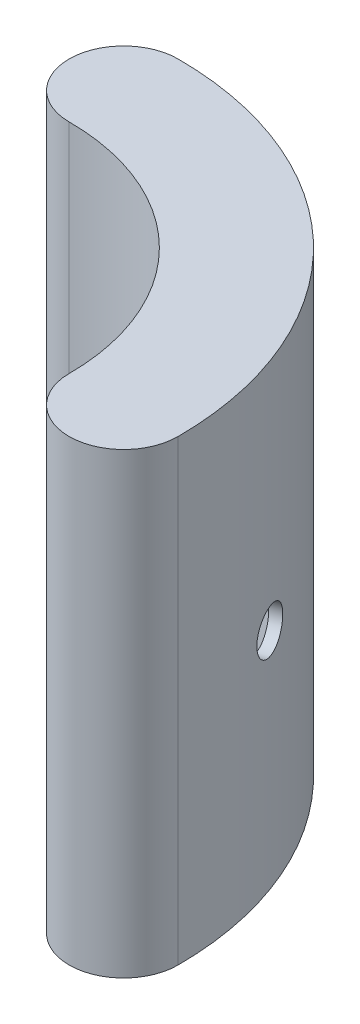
ISO-10303-21;
HEADER;
FILE_DESCRIPTION(('STEP AP214'),'2;1');
FILE_NAME('part.step','',(''),(''),'','','');
FILE_SCHEMA(('AUTOMOTIVE_DESIGN { 1 0 10303 214 1 1 1 1 }'));
ENDSEC;
DATA;
#1=APPLICATION_CONTEXT('core data for automotive mechanical design processes');
#2=APPLICATION_PROTOCOL_DEFINITION('international standard','automotive_design',2000,#1);
#3=PRODUCT_CONTEXT('',#1,'mechanical');
#4=PRODUCT('Part','Part','',(#3));
#5=PRODUCT_RELATED_PRODUCT_CATEGORY('part','',(#4));
#6=PRODUCT_DEFINITION_FORMATION('','',#4);
#7=PRODUCT_DEFINITION_CONTEXT('part definition',#1,'design');
#8=PRODUCT_DEFINITION('design','',#6,#7);
#9=PRODUCT_DEFINITION_SHAPE('','',#8);
#10=(LENGTH_UNIT() NAMED_UNIT(*) SI_UNIT(.MILLI.,.METRE.));
#11=(NAMED_UNIT(*) PLANE_ANGLE_UNIT() SI_UNIT($,.RADIAN.));
#12=(NAMED_UNIT(*) SI_UNIT($,.STERADIAN.) SOLID_ANGLE_UNIT());
#13=UNCERTAINTY_MEASURE_WITH_UNIT(LENGTH_MEASURE(1.E-05),#10,'distance_accuracy_value','');
#14=(GEOMETRIC_REPRESENTATION_CONTEXT(3) GLOBAL_UNCERTAINTY_ASSIGNED_CONTEXT((#13)) GLOBAL_UNIT_ASSIGNED_CONTEXT((#10,
#11,#12)) REPRESENTATION_CONTEXT('',''));
#15=CARTESIAN_POINT('',(0.,0.,0.));
#16=DIRECTION('',(0.,0.,1.));
#17=DIRECTION('',(1.,0.,0.));
#18=AXIS2_PLACEMENT_3D('',#15,#16,#17);
#19=CARTESIAN_POINT('',(0.,101.6,-63.5));
#20=DIRECTION('',(0.,-1.,0.));
#21=DIRECTION('',(0.,0.,-1.));
#22=AXIS2_PLACEMENT_3D('',#19,#20,#21);
#23=CYLINDRICAL_SURFACE('',#22,12.7);
#24=DIRECTION('',(0.,-1.,0.));
#25=VECTOR('',#24,1.);
#26=CARTESIAN_POINT('',(0.,101.6,-76.2));
#27=LINE('',#26,#25);
#28=CARTESIAN_POINT('',(0.,104.14,-76.2));
#29=VERTEX_POINT('',#28);
#30=CARTESIAN_POINT('',(0.,-2.54,-76.2));
#31=VERTEX_POINT('',#30);
#32=EDGE_CURVE('E109',#29,#31,#27,.T.);
#33=ORIENTED_EDGE('',*,*,#32,.T.);
#34=CARTESIAN_POINT('',(0.,-2.54,-63.5));
#35=DIRECTION('',(0.,-1.,0.));
#36=DIRECTION('',(0.,0.,-1.));
#37=AXIS2_PLACEMENT_3D('',#34,#35,#36);
#38=CIRCLE('',#37,12.7);
#39=CARTESIAN_POINT('',(0.,-2.54,-50.8));
#40=VERTEX_POINT('',#39);
#41=EDGE_CURVE('E187',#40,#31,#38,.T.);
#42=ORIENTED_EDGE('',*,*,#41,.F.);
#43=DIRECTION('',(0.,-1.,0.));
#44=VECTOR('',#43,1.);
#45=CARTESIAN_POINT('',(0.,101.6,-50.8));
#46=LINE('',#45,#44);
#47=CARTESIAN_POINT('',(0.,104.14,-50.8));
#48=VERTEX_POINT('',#47);
#49=EDGE_CURVE('E11',#48,#40,#46,.T.);
#50=ORIENTED_EDGE('',*,*,#49,.F.);
#51=CARTESIAN_POINT('',(0.,104.14,-63.5));
#52=DIRECTION('',(0.,1.,0.));
#53=DIRECTION('',(0.,0.,1.));
#54=AXIS2_PLACEMENT_3D('',#51,#52,#53);
#55=CIRCLE('',#54,12.7);
#56=EDGE_CURVE('E201',#29,#48,#55,.T.);
#57=ORIENTED_EDGE('',*,*,#56,.F.);
#58=EDGE_LOOP('',(#33,#42,#50,#57));
#59=FACE_BOUND('',#58,.T.);
#60=ADVANCED_FACE('F35',(#59),#23,.T.);
#61=CARTESIAN_POINT('',(0.,101.6,0.));
#62=DIRECTION('',(0.,-1.,0.));
#63=DIRECTION('',(0.,0.,-1.));
#64=AXIS2_PLACEMENT_3D('',#61,#62,#63);
#65=CYLINDRICAL_SURFACE('',#64,50.8);
#66=ORIENTED_EDGE('',*,*,#49,.T.);
#67=CARTESIAN_POINT('',(0.,-2.54,0.));
#68=DIRECTION('',(0.,1.,0.));
#69=DIRECTION('',(0.,0.,-1.));
#70=AXIS2_PLACEMENT_3D('',#67,#68,#69);
#71=CIRCLE('',#70,50.8);
#72=CARTESIAN_POINT('',(50.8,-2.54,0.));
#73=VERTEX_POINT('',#72);
#74=EDGE_CURVE('E175',#73,#40,#71,.T.);
#75=ORIENTED_EDGE('',*,*,#74,.F.);
#76=DIRECTION('',(0.,-1.,0.));
#77=VECTOR('',#76,1.);
#78=CARTESIAN_POINT('',(50.8,101.6,0.));
#79=LINE('',#78,#77);
#80=CARTESIAN_POINT('',(50.8,104.14,0.));
#81=VERTEX_POINT('',#80);
#82=EDGE_CURVE('E48',#81,#73,#79,.T.);
#83=ORIENTED_EDGE('',*,*,#82,.F.);
#84=CARTESIAN_POINT('',(0.,104.14,0.));
#85=DIRECTION('',(0.,-1.,0.));
#86=DIRECTION('',(0.,0.,1.));
#87=AXIS2_PLACEMENT_3D('',#84,#85,#86);
#88=CIRCLE('',#87,50.8);
#89=EDGE_CURVE('E98',#48,#81,#88,.T.);
#90=ORIENTED_EDGE('',*,*,#89,.F.);
#91=EDGE_LOOP('',(#66,#75,#83,#90));
#92=FACE_BOUND('',#91,.T.);
#93=ADVANCED_FACE('F160',(#92),#65,.F.);
#94=CARTESIAN_POINT('',(63.5,101.6,0.));
#95=DIRECTION('',(0.,-1.,0.));
#96=DIRECTION('',(0.,0.,-1.));
#97=AXIS2_PLACEMENT_3D('',#94,#95,#96);
#98=CYLINDRICAL_SURFACE('',#97,12.7);
#99=ORIENTED_EDGE('',*,*,#82,.T.);
#100=CARTESIAN_POINT('',(63.5,-2.54,0.));
#101=DIRECTION('',(0.,-1.,0.));
#102=DIRECTION('',(0.,0.,-1.));
#103=AXIS2_PLACEMENT_3D('',#100,#101,#102);
#104=CIRCLE('',#103,12.7);
#105=CARTESIAN_POINT('',(76.2,-2.54,0.));
#106=VERTEX_POINT('',#105);
#107=EDGE_CURVE('E144',#106,#73,#104,.T.);
#108=ORIENTED_EDGE('',*,*,#107,.F.);
#109=DIRECTION('',(0.,-1.,0.));
#110=VECTOR('',#109,1.);
#111=CARTESIAN_POINT('',(76.2,101.6,0.));
#112=LINE('',#111,#110);
#113=CARTESIAN_POINT('',(76.2,104.14,0.));
#114=VERTEX_POINT('',#113);
#115=EDGE_CURVE('E112',#114,#106,#112,.T.);
#116=ORIENTED_EDGE('',*,*,#115,.F.);
#117=CARTESIAN_POINT('',(63.5,104.14,0.));
#118=DIRECTION('',(0.,1.,0.));
#119=DIRECTION('',(0.,0.,1.));
#120=AXIS2_PLACEMENT_3D('',#117,#118,#119);
#121=CIRCLE('',#120,12.7);
#122=EDGE_CURVE('E193',#81,#114,#121,.T.);
#123=ORIENTED_EDGE('',*,*,#122,.F.);
#124=EDGE_LOOP('',(#99,#108,#116,#123));
#125=FACE_BOUND('',#124,.T.);
#126=ADVANCED_FACE('F154',(#125),#98,.T.);
#127=CARTESIAN_POINT('',(0.,101.6,0.));
#128=DIRECTION('',(0.,-1.,0.));
#129=DIRECTION('',(0.,0.,-1.));
#130=AXIS2_PLACEMENT_3D('',#127,#128,#129);
#131=CYLINDRICAL_SURFACE('',#130,76.2);
#132=CARTESIAN_POINT('',(22.4061096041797,49.53,-72.8313548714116));
#133=CARTESIAN_POINT('',(22.406117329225,49.3517419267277,-72.8313530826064));
#134=CARTESIAN_POINT('',(22.4205204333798,49.17335656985,-72.8269263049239));
#135=CARTESIAN_POINT('',(22.4777569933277,48.8215043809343,-72.809280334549));
#136=CARTESIAN_POINT('',(22.5206241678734,48.6480436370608,-72.7960507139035));
#137=CARTESIAN_POINT('',(22.6335097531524,48.3111886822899,-72.7610315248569));
#138=CARTESIAN_POINT('',(22.7035145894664,48.1477894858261,-72.7392462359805));
#139=CARTESIAN_POINT('',(22.8685889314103,47.8356534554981,-72.6875167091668));
#140=CARTESIAN_POINT('',(22.9636524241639,47.6869131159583,-72.6575744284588));
#141=CARTESIAN_POINT('',(23.176127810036,47.4081609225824,-72.5900784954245));
#142=CARTESIAN_POINT('',(23.2935541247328,47.2781612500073,-72.5525199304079));
#143=CARTESIAN_POINT('',(23.547287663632,47.0406840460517,-72.4705663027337));
#144=CARTESIAN_POINT('',(23.6835956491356,46.9332074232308,-72.4261709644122));
#145=CARTESIAN_POINT('',(23.9711766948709,46.7437979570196,-72.3314978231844));
#146=CARTESIAN_POINT('',(24.122454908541,46.6618739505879,-72.2812179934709));
#147=CARTESIAN_POINT('',(24.4355584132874,46.5259521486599,-72.1759706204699));
#148=CARTESIAN_POINT('',(24.5973836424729,46.4719541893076,-72.1210031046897));
#149=CARTESIAN_POINT('',(24.9268261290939,46.3934476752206,-72.0078026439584));
#150=CARTESIAN_POINT('',(25.094439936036,46.3689218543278,-71.9495716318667));
#151=CARTESIAN_POINT('',(25.4307570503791,46.3500025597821,-71.8313884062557));
#152=CARTESIAN_POINT('',(25.5994603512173,46.3556089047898,-71.7714362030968));
#153=CARTESIAN_POINT('',(25.9330641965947,46.3967803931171,-71.6515707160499));
#154=CARTESIAN_POINT('',(26.0979670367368,46.4323269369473,-71.5916574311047));
#155=CARTESIAN_POINT('',(26.4194422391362,46.5323409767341,-71.4736483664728));
#156=CARTESIAN_POINT('',(26.5760145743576,46.596808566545,-71.4155525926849));
#157=CARTESIAN_POINT('',(26.8765115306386,46.7528559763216,-71.3030077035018));
#158=CARTESIAN_POINT('',(27.0204321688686,46.8444442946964,-71.2485597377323));
#159=CARTESIAN_POINT('',(27.2915908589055,47.0521270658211,-71.1451344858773));
#160=CARTESIAN_POINT('',(27.4188288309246,47.1682216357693,-71.0961572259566));
#161=CARTESIAN_POINT('',(27.6532161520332,47.4217266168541,-71.0053201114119));
#162=CARTESIAN_POINT('',(27.7603501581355,47.5591531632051,-70.9634656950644));
#163=CARTESIAN_POINT('',(27.9514757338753,47.8513642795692,-70.8884023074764));
#164=CARTESIAN_POINT('',(28.0354672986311,48.0061488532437,-70.8551933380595));
#165=CARTESIAN_POINT('',(28.1780148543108,48.3286917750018,-70.7986256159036));
#166=CARTESIAN_POINT('',(28.2365703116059,48.4964503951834,-70.7752670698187));
#167=CARTESIAN_POINT('',(28.3266435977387,48.8401750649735,-70.739265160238));
#168=CARTESIAN_POINT('',(28.3581615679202,49.0161410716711,-70.7266217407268));
#169=CARTESIAN_POINT('',(28.3932861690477,49.3711437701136,-70.712528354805));
#170=CARTESIAN_POINT('',(28.3969137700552,49.5501780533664,-70.7110699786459));
#171=CARTESIAN_POINT('',(28.3762139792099,49.9063597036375,-70.7193792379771));
#172=CARTESIAN_POINT('',(28.3518866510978,50.0835070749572,-70.7291468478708));
#173=CARTESIAN_POINT('',(28.2759541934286,50.4308231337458,-70.7595369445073));
#174=CARTESIAN_POINT('',(28.2243586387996,50.6009942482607,-70.7801556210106));
#175=CARTESIAN_POINT('',(28.0953014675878,50.9296019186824,-70.831481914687));
#176=CARTESIAN_POINT('',(28.0178397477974,51.0880384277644,-70.8621895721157));
#177=CARTESIAN_POINT('',(27.8391077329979,51.388783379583,-70.9325967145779));
#178=CARTESIAN_POINT('',(27.7378232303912,51.5310821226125,-70.9723015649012));
#179=CARTESIAN_POINT('',(27.514238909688,51.7954147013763,-71.0592781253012));
#180=CARTESIAN_POINT('',(27.3919389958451,51.9174484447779,-71.1065498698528));
#181=CARTESIAN_POINT('',(27.1295992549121,52.1378625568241,-71.2070540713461));
#182=CARTESIAN_POINT('',(26.9895485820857,52.2362283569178,-71.2602901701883));
#183=CARTESIAN_POINT('',(26.695639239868,52.406414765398,-71.3709147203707));
#184=CARTESIAN_POINT('',(26.5417806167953,52.4782354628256,-71.4283031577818));
#185=CARTESIAN_POINT('',(26.2245960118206,52.5932674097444,-71.5453639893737));
#186=CARTESIAN_POINT('',(26.0612731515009,52.6364880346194,-71.6050356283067));
#187=CARTESIAN_POINT('',(25.7297045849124,52.6931236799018,-71.7248448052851));
#188=CARTESIAN_POINT('',(25.5614588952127,52.7065388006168,-71.7849823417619));
#189=CARTESIAN_POINT('',(25.2249413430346,52.7031815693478,-71.9039231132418));
#190=CARTESIAN_POINT('',(25.0566695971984,52.686432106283,-71.9627273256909));
#191=CARTESIAN_POINT('',(24.7247690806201,52.6232683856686,-72.0774350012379));
#192=CARTESIAN_POINT('',(24.5611403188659,52.5768540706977,-72.1333384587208));
#193=CARTESIAN_POINT('',(24.2432179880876,52.4556824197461,-72.2408095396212));
#194=CARTESIAN_POINT('',(24.0889245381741,52.3809247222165,-72.2923771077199));
#195=CARTESIAN_POINT('',(23.7941293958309,52.2051933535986,-72.3899409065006));
#196=CARTESIAN_POINT('',(23.6536272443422,52.1042205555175,-72.4359373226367));
#197=CARTESIAN_POINT('',(23.3903950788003,51.8788468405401,-72.5213666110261));
#198=CARTESIAN_POINT('',(23.2676766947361,51.7544307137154,-72.5607951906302));
#199=CARTESIAN_POINT('',(23.0436743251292,51.4856980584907,-72.6322444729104));
#200=CARTESIAN_POINT('',(22.9423956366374,51.34137662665,-72.6642633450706));
#201=CARTESIAN_POINT('',(22.7642158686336,51.0368439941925,-72.720280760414));
#202=CARTESIAN_POINT('',(22.6873346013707,50.8766200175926,-72.7442727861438));
#203=CARTESIAN_POINT('',(22.5604053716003,50.5450431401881,-72.7837383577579));
#204=CARTESIAN_POINT('',(22.5103255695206,50.3737037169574,-72.7992220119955));
#205=CARTESIAN_POINT('',(22.4516828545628,50.0894093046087,-72.8173225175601));
#206=CARTESIAN_POINT('',(22.4346153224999,49.9782976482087,-72.8225801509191));
#207=CARTESIAN_POINT('',(22.4118262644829,49.7548075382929,-72.8295968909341));
#208=CARTESIAN_POINT('',(22.4061047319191,49.6424290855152,-72.8313559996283));
#209=CARTESIAN_POINT('',(22.4061096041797,49.53,-72.8313548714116));
#210=B_SPLINE_CURVE_WITH_KNOTS('',3,(#132,#133,#134,#135,#136,#137,#138,#139,#140,#141,#142,
#143,#144,#145,#146,#147,#148,#149,#150,#151,#152,#153,#154,#155,#156,#157,#158,#159,#160,#161,
#162,#163,#164,#165,#166,#167,#168,#169,#170,#171,#172,#173,#174,#175,#176,#177,#178,#179,#180,
#181,#182,#183,#184,#185,#186,#187,#188,#189,#190,#191,#192,#193,#194,#195,#196,#197,#198,#199,
#200,#201,#202,#203,#204,#205,#206,#207,#208,#209),.UNSPECIFIED.,.T.,.F.,(4,2,2,2,2,2,2,2,2,2,2,
2,2,2,2,2,2,2,2,2,2,2,2,2,2,2,2,2,2,2,2,2,2,2,2,2,2,2,4),(0.,0.534363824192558,1.06936179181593,
1.60409249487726,2.13869500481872,2.67364344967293,3.20861346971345,3.74376829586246,
4.27891998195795,4.81375799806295,5.34859279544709,5.8830955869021,6.41760011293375,
6.95227230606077,7.48694705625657,8.02202821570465,8.55710948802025,9.09220198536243,
9.62729168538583,10.1619790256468,10.6966651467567,11.2311636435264,11.7656642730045,
12.3004844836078,12.8353071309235,13.3704581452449,13.905607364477,14.4405810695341,
14.9755529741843,15.5101191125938,16.0446862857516,16.5792602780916,17.1138164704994,
17.6487206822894,18.1837568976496,18.7192264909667,19.2540585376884,19.5910871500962,
19.9281155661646),.UNSPECIFIED.);
#211=CARTESIAN_POINT('',(22.4061096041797,49.53,-72.8313548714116));
#212=VERTEX_POINT('',#211);
#213=EDGE_CURVE('E122',#212,#212,#210,.T.);
#214=ORIENTED_EDGE('',*,*,#213,.T.);
#215=EDGE_LOOP('',(#214));
#216=FACE_BOUND('',#215,.T.);
#217=CARTESIAN_POINT('',(69.6256740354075,49.53,-30.9629700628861));
#218=CARTESIAN_POINT('',(69.6256734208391,49.3874463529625,-30.9629711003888));
#219=CARTESIAN_POINT('',(69.6281192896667,49.2449115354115,-30.957473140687));
#220=CARTESIAN_POINT('',(69.6378768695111,48.9608098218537,-30.9355176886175));
#221=CARTESIAN_POINT('',(69.645189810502,48.8192431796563,-30.919057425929));
#222=CARTESIAN_POINT('',(69.6646151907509,48.5380141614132,-30.8752645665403));
#223=CARTESIAN_POINT('',(69.6767317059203,48.3983535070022,-30.8479227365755));
#224=CARTESIAN_POINT('',(69.7056428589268,48.1219989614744,-30.7825377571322));
#225=CARTESIAN_POINT('',(69.7224392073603,47.9853061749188,-30.7444906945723));
#226=CARTESIAN_POINT('',(69.7605170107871,47.7160343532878,-30.6579923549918));
#227=CARTESIAN_POINT('',(69.7817943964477,47.5834517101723,-30.6095505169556));
#228=CARTESIAN_POINT('',(69.8286343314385,47.323161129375,-30.5025447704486));
#229=CARTESIAN_POINT('',(69.8541984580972,47.1954550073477,-30.4439771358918));
#230=CARTESIAN_POINT('',(69.909331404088,46.9459467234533,-30.3171594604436));
#231=CARTESIAN_POINT('',(69.9388978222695,46.8241410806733,-30.2489152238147));
#232=CARTESIAN_POINT('',(70.0017643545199,46.5871670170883,-30.1031441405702));
#233=CARTESIAN_POINT('',(70.0350658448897,46.4720010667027,-30.0256138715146));
#234=CARTESIAN_POINT('',(70.10510671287,46.2490414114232,-29.8617139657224));
#235=CARTESIAN_POINT('',(70.1418499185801,46.1412561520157,-29.7753344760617));
#236=CARTESIAN_POINT('',(70.2184020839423,45.9339233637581,-29.5943518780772));
#237=CARTESIAN_POINT('',(70.2582121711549,45.8343788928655,-29.4997457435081));
#238=CARTESIAN_POINT('',(70.3404958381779,45.6443074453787,-29.3030033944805));
#239=CARTESIAN_POINT('',(70.3829685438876,45.55377753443,-29.2008696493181));
#240=CARTESIAN_POINT('',(70.47021171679,45.382307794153,-28.9896932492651));
#241=CARTESIAN_POINT('',(70.5149830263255,45.3013715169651,-28.8806480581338));
#242=CARTESIAN_POINT('',(70.6064287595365,45.1496612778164,-28.6563586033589));
#243=CARTESIAN_POINT('',(70.6531042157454,45.0788929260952,-28.5411109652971));
#244=CARTESIAN_POINT('',(70.7479384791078,44.9480524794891,-28.305218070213));
#245=CARTESIAN_POINT('',(70.7960978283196,44.8879843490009,-28.1845708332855));
#246=CARTESIAN_POINT('',(70.8934542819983,44.7790273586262,-27.938782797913));
#247=CARTESIAN_POINT('',(70.9426509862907,44.730134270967,-27.8136437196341));
#248=CARTESIAN_POINT('',(71.0416899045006,44.6438352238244,-27.5596977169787));
#249=CARTESIAN_POINT('',(71.0915323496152,44.6064335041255,-27.4308894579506));
#250=CARTESIAN_POINT('',(71.241231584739,44.5120548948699,-27.0407836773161));
#251=CARTESIAN_POINT('',(71.341514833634,44.4726210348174,-26.7751639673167));
#252=CARTESIAN_POINT('',(71.5398962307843,44.441985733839,-26.2405164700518));
#253=CARTESIAN_POINT('',(71.6379944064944,44.4507836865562,-25.9714887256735));
#254=CARTESIAN_POINT('',(71.82917627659,44.5162414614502,-25.437955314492));
#255=CARTESIAN_POINT('',(71.9222676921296,44.5728252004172,-25.1734431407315));
#256=CARTESIAN_POINT('',(72.1012425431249,44.7321469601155,-24.6561514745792));
#257=CARTESIAN_POINT('',(72.1871259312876,44.8348852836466,-24.4033720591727));
#258=CARTESIAN_POINT('',(72.3498384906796,45.0836813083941,-23.9166643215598));
#259=CARTESIAN_POINT('',(72.4266604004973,45.2297734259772,-23.6827511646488));
#260=CARTESIAN_POINT('',(72.5696738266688,45.5611061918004,-23.2408363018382));
#261=CARTESIAN_POINT('',(72.6358652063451,45.7463473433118,-23.032834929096));
#262=CARTESIAN_POINT('',(72.7566235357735,46.1511492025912,-22.6484984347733));
#263=CARTESIAN_POINT('',(72.8111676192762,46.3707759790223,-22.4722257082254));
#264=CARTESIAN_POINT('',(72.907677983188,46.837883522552,-22.1571148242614));
#265=CARTESIAN_POINT('',(72.9496442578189,47.0853643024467,-22.0182766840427));
#266=CARTESIAN_POINT('',(73.0204759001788,47.6011977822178,-21.782225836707));
#267=CARTESIAN_POINT('',(73.0493403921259,47.8695518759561,-21.685015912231));
#268=CARTESIAN_POINT('',(73.0936440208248,48.4194945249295,-21.5352120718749));
#269=CARTESIAN_POINT('',(73.1090833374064,48.7010829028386,-21.4826175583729));
#270=CARTESIAN_POINT('',(73.1263635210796,49.2689208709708,-21.4237232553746));
#271=CARTESIAN_POINT('',(73.1282304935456,49.5551604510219,-21.417334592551));
#272=CARTESIAN_POINT('',(73.1184167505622,50.1246853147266,-21.4508140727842));
#273=CARTESIAN_POINT('',(73.1067361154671,50.4079706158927,-21.4906819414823));
#274=CARTESIAN_POINT('',(73.0699607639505,50.9632834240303,-21.6153882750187));
#275=CARTESIAN_POINT('',(73.0448782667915,51.235320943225,-21.7001857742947));
#276=CARTESIAN_POINT('',(72.9815754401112,51.7607252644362,-21.9121383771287));
#277=CARTESIAN_POINT('',(72.9433549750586,52.0140918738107,-22.0392939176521));
#278=CARTESIAN_POINT('',(72.854166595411,52.4953865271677,-22.3323490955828));
#279=CARTESIAN_POINT('',(72.8031793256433,52.7232751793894,-22.4983075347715));
#280=CARTESIAN_POINT('',(72.6891916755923,53.146747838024,-22.8639011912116));
#281=CARTESIAN_POINT('',(72.6261911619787,53.3423314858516,-23.0635367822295));
#282=CARTESIAN_POINT('',(72.4890839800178,53.6959554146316,-23.4909143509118));
#283=CARTESIAN_POINT('',(72.4149599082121,53.8539358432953,-23.7187002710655));
#284=CARTESIAN_POINT('',(72.2570666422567,54.1274575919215,-24.1954389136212));
#285=CARTESIAN_POINT('',(72.1732975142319,54.2429992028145,-24.444391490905));
#286=CARTESIAN_POINT('',(71.9980171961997,54.4282652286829,-24.9559325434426));
#287=CARTESIAN_POINT('',(71.9065124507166,54.4980273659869,-25.2185095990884));
#288=CARTESIAN_POINT('',(71.7178723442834,54.5898567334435,-25.750069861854));
#289=CARTESIAN_POINT('',(71.6207370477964,54.611924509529,-26.0190529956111));
#290=CARTESIAN_POINT('',(71.4730426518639,54.6088373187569,-26.4209146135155));
#291=CARTESIAN_POINT('',(71.4235011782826,54.6017876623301,-26.5545420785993));
#292=CARTESIAN_POINT('',(71.3240633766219,54.5757369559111,-26.8204784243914));
#293=CARTESIAN_POINT('',(71.2741671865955,54.5567403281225,-26.952787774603));
#294=CARTESIAN_POINT('',(71.174378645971,54.5069177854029,-27.2152082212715));
#295=CARTESIAN_POINT('',(71.1244863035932,54.476087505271,-27.3453184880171));
#296=CARTESIAN_POINT('',(71.0251324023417,54.4028357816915,-27.602346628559));
#297=CARTESIAN_POINT('',(70.9756706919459,54.3604186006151,-27.7292656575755));
#298=CARTESIAN_POINT('',(70.8775475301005,54.2642743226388,-27.979122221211));
#299=CARTESIAN_POINT('',(70.8288863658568,54.210543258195,-28.1020583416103));
#300=CARTESIAN_POINT('',(70.7328099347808,54.092185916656,-28.3430135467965));
#301=CARTESIAN_POINT('',(70.6853942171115,54.0275636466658,-28.4610344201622));
#302=CARTESIAN_POINT('',(70.5921853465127,53.8878457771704,-28.6914415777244));
#303=CARTESIAN_POINT('',(70.5463927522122,53.8127466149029,-28.803825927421));
#304=CARTESIAN_POINT('',(70.4568712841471,53.6526537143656,-29.0221157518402));
#305=CARTESIAN_POINT('',(70.4131416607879,53.5676636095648,-29.1280235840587));
#306=CARTESIAN_POINT('',(70.3280333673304,53.3881703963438,-29.3329176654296));
#307=CARTESIAN_POINT('',(70.2866600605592,53.2936468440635,-29.431888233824));
#308=CARTESIAN_POINT('',(70.2067702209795,53.0959482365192,-29.6219520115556));
#309=CARTESIAN_POINT('',(70.1682526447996,52.992776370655,-29.7130480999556));
#310=CARTESIAN_POINT('',(70.0944023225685,52.77841417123,-29.8868480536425));
#311=CARTESIAN_POINT('',(70.0590715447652,52.6672189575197,-29.9695467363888));
#312=CARTESIAN_POINT('',(69.9919778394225,52.4376949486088,-30.1259070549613));
#313=CARTESIAN_POINT('',(69.9602136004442,52.3193688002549,-30.1995720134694));
#314=CARTESIAN_POINT('',(69.9005008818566,52.0761723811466,-30.3375285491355));
#315=CARTESIAN_POINT('',(69.8725590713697,51.9512911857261,-30.4018037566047));
#316=CARTESIAN_POINT('',(69.8208474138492,51.6961070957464,-30.5203776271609));
#317=CARTESIAN_POINT('',(69.7970760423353,51.5658062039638,-30.5746799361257));
#318=CARTESIAN_POINT('',(69.7539540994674,51.3007771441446,-30.6729321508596));
#319=CARTESIAN_POINT('',(69.7345997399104,51.166052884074,-30.7168909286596));
#320=CARTESIAN_POINT('',(69.7004901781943,50.8930765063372,-30.7942113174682));
#321=CARTESIAN_POINT('',(69.6857338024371,50.7548252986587,-30.8275756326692));
#322=CARTESIAN_POINT('',(69.6575510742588,50.4372193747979,-30.8912143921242));
#323=CARTESIAN_POINT('',(69.6456132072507,50.2570415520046,-30.9181005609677));
#324=CARTESIAN_POINT('',(69.6296750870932,49.8945655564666,-30.9539777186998));
#325=CARTESIAN_POINT('',(69.6256748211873,49.71226738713,-30.9629687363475));
#326=CARTESIAN_POINT('',(69.6256740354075,49.53,-30.9629700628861));
#327=B_SPLINE_CURVE_WITH_KNOTS('',3,(#217,#218,#219,#220,#221,#222,#223,#224,#225,#226,#227,
#228,#229,#230,#231,#232,#233,#234,#235,#236,#237,#238,#239,#240,#241,#242,#243,#244,#245,#246,
#247,#248,#249,#250,#251,#252,#253,#254,#255,#256,#257,#258,#259,#260,#261,#262,#263,#264,#265,
#266,#267,#268,#269,#270,#271,#272,#273,#274,#275,#276,#277,#278,#279,#280,#281,#282,#283,#284,
#285,#286,#287,#288,#289,#290,#291,#292,#293,#294,#295,#296,#297,#298,#299,#300,#301,#302,#303,
#304,#305,#306,#307,#308,#309,#310,#311,#312,#313,#314,#315,#316,#317,#318,#319,#320,#321,#322,
#323,#324,#325,#326),.UNSPECIFIED.,.T.,.F.,(4,2,2,2,2,2,2,2,2,2,2,2,2,2,2,2,2,2,2,2,2,2,2,2,2,2,
2,2,2,2,2,2,2,2,2,2,2,2,2,2,2,2,2,2,2,2,2,2,2,2,2,2,2,2,4),(0.,0.427501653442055,
0.855111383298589,1.28308472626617,1.71121470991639,2.13895756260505,2.56685815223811,
2.99450315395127,3.42230625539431,3.85059096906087,4.27903390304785,4.70733691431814,
5.13579801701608,5.56449462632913,5.99334973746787,6.42204233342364,6.85089290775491,
7.70638479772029,8.56186593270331,9.41598755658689,10.2701147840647,11.1249218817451,
11.9797399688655,12.8362211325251,13.6927026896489,14.5492414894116,15.4057688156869,
16.2606482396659,17.1155225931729,17.969618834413,18.8237238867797,19.6791317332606,
20.5345490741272,21.3913189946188,22.2480830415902,23.1041402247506,23.9601876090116,
24.3878408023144,24.8153357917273,25.2429886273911,25.6704843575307,26.098130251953,
26.5256191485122,26.9532537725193,27.3807317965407,27.8091468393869,28.2374045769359,
28.6659250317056,29.0942873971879,29.523387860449,29.9523311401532,30.3809051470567,
30.8093696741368,31.3559690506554,31.9025675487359),.UNSPECIFIED.);
#328=CARTESIAN_POINT('',(69.6256740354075,49.53,-30.9629700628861));
#329=VERTEX_POINT('',#328);
#330=EDGE_CURVE('E121',#329,#329,#327,.T.);
#331=ORIENTED_EDGE('',*,*,#330,.T.);
#332=EDGE_LOOP('',(#331));
#333=FACE_BOUND('',#332,.T.);
#334=ORIENTED_EDGE('',*,*,#115,.T.);
#335=CARTESIAN_POINT('',(0.,-2.54,0.));
#336=DIRECTION('',(0.,-1.,0.));
#337=DIRECTION('',(0.,0.,-1.));
#338=AXIS2_PLACEMENT_3D('',#335,#336,#337);
#339=CIRCLE('',#338,76.2);
#340=EDGE_CURVE('E191',#31,#106,#339,.T.);
#341=ORIENTED_EDGE('',*,*,#340,.F.);
#342=ORIENTED_EDGE('',*,*,#32,.F.);
#343=CARTESIAN_POINT('',(0.,104.14,0.));
#344=DIRECTION('',(0.,1.,0.));
#345=DIRECTION('',(0.,0.,1.));
#346=AXIS2_PLACEMENT_3D('',#343,#344,#345);
#347=CIRCLE('',#346,76.2);
#348=EDGE_CURVE('E198',#114,#29,#347,.T.);
#349=ORIENTED_EDGE('',*,*,#348,.F.);
#350=EDGE_LOOP('',(#334,#341,#342,#349));
#351=FACE_BOUND('',#350,.T.);
#352=ADVANCED_FACE('F148',(#216,#333,#351),#131,.T.);
#353=CARTESIAN_POINT('',(31.75,104.14,0.));
#354=DIRECTION('',(0.,1.,0.));
#355=DIRECTION('',(0.,0.,1.));
#356=AXIS2_PLACEMENT_3D('',#353,#354,#355);
#357=PLANE('',#356);
#358=ORIENTED_EDGE('',*,*,#122,.T.);
#359=ORIENTED_EDGE('',*,*,#348,.T.);
#360=ORIENTED_EDGE('',*,*,#56,.T.);
#361=ORIENTED_EDGE('',*,*,#89,.T.);
#362=EDGE_LOOP('',(#358,#359,#360,#361));
#363=FACE_BOUND('',#362,.T.);
#364=ADVANCED_FACE('F153',(#363),#357,.T.);
#365=CARTESIAN_POINT('',(31.75,-2.54,0.));
#366=DIRECTION('',(0.,-1.,0.));
#367=DIRECTION('',(0.,0.,-1.));
#368=AXIS2_PLACEMENT_3D('',#365,#366,#367);
#369=PLANE('',#368);
#370=ORIENTED_EDGE('',*,*,#107,.T.);
#371=ORIENTED_EDGE('',*,*,#74,.T.);
#372=ORIENTED_EDGE('',*,*,#41,.T.);
#373=ORIENTED_EDGE('',*,*,#340,.T.);
#374=EDGE_LOOP('',(#370,#371,#372,#373));
#375=FACE_BOUND('',#374,.T.);
#376=ADVANCED_FACE('F131',(#375),#369,.T.);
#377=CARTESIAN_POINT('',(66.6119785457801,49.53,-24.4457012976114));
#378=DIRECTION('',(0.938779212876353,0.,-0.344519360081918));
#379=DIRECTION('',(-0.344519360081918,0.,-0.938779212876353));
#380=AXIS2_PLACEMENT_3D('',#377,#378,#379);
#381=CYLINDRICAL_SURFACE('',#380,5.08);
#382=CARTESIAN_POINT('',(67.2356742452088,49.53,-30.0858722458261));
#383=CARTESIAN_POINT('',(67.2356736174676,49.3874583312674,-30.0858732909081));
#384=CARTESIAN_POINT('',(67.238132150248,49.2449356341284,-30.0803810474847));
#385=CARTESIAN_POINT('',(67.2479399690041,48.960858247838,-30.058448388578));
#386=CARTESIAN_POINT('',(67.2552904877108,48.8193038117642,-30.0420052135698));
#387=CARTESIAN_POINT('',(67.2748148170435,48.5380997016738,-29.9982576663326));
#388=CARTESIAN_POINT('',(67.286992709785,48.3984517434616,-29.970944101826));
#389=CARTESIAN_POINT('',(67.3160485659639,48.1221225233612,-29.9056262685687));
#390=CARTESIAN_POINT('',(67.3329282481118,47.9854423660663,-29.8676180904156));
#391=CARTESIAN_POINT('',(67.3711919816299,47.7161960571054,-29.7812074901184));
#392=CARTESIAN_POINT('',(67.3925719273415,47.5836262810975,-29.7328145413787));
#393=CARTESIAN_POINT('',(67.4396333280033,47.323360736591,-29.6259154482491));
#394=CARTESIAN_POINT('',(67.4653163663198,47.1956667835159,-29.5674055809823));
#395=CARTESIAN_POINT('',(67.5206999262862,46.9461814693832,-29.4407108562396));
#396=CARTESIAN_POINT('',(67.5503980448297,46.8243866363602,-29.3725317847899));
#397=CARTESIAN_POINT('',(67.6135370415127,46.5874324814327,-29.2268969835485));
#398=CARTESIAN_POINT('',(67.6469792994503,46.4722756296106,-29.1494378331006));
#399=CARTESIAN_POINT('',(67.7173102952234,46.2493210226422,-28.9856763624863));
#400=CARTESIAN_POINT('',(67.7542031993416,46.1415324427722,-28.899363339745));
#401=CARTESIAN_POINT('',(67.8310562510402,45.9341919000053,-28.718514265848));
#402=CARTESIAN_POINT('',(67.8710175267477,45.8346429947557,-28.6239751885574));
#403=CARTESIAN_POINT('',(67.9536007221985,45.6445613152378,-28.4273655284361));
#404=CARTESIAN_POINT('',(67.9962217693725,45.5540256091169,-28.3252974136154));
#405=CARTESIAN_POINT('',(68.083754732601,45.3825428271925,-28.1142489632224));
#406=CARTESIAN_POINT('',(68.1286674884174,45.3015993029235,-28.0052660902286));
#407=CARTESIAN_POINT('',(68.2203883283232,45.1498681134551,-27.7810886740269));
#408=CARTESIAN_POINT('',(68.2671975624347,45.0790867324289,-27.6658903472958));
#409=CARTESIAN_POINT('',(68.3622850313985,44.9482203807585,-27.43008850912));
#410=CARTESIAN_POINT('',(68.4105638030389,44.8881393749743,-27.3094830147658));
#411=CARTESIAN_POINT('',(68.5081412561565,44.7791571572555,-27.0637696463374));
#412=CARTESIAN_POINT('',(68.5574395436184,44.7302517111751,-26.9386634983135));
#413=CARTESIAN_POINT('',(68.6566610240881,44.6439287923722,-26.6847735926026));
#414=CARTESIAN_POINT('',(68.7065844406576,44.6065155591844,-26.5559884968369));
#415=CARTESIAN_POINT('',(68.8564811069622,44.5121108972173,-26.1659638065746));
#416=CARTESIAN_POINT('',(68.9568463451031,44.4726593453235,-25.9003876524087));
#417=CARTESIAN_POINT('',(69.1552889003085,44.4419853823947,-25.3657853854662));
#418=CARTESIAN_POINT('',(69.2533662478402,44.4507623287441,-25.0967593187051));
#419=CARTESIAN_POINT('',(69.4443946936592,44.5161713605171,-24.5632196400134));
#420=CARTESIAN_POINT('',(69.5373542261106,44.5727220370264,-24.298699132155));
#421=CARTESIAN_POINT('',(69.7159794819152,44.7319635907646,-23.7813533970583));
#422=CARTESIAN_POINT('',(69.8016451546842,44.8346547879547,-23.5285282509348));
#423=CARTESIAN_POINT('',(69.9638649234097,45.0833496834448,-23.0416831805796));
#424=CARTESIAN_POINT('',(70.0404112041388,45.2293901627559,-22.8076794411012));
#425=CARTESIAN_POINT('',(70.1828422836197,45.5606125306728,-22.3655602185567));
#426=CARTESIAN_POINT('',(70.2487269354,45.7457949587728,-22.1574450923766));
#427=CARTESIAN_POINT('',(70.3688836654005,46.1505038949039,-21.7728404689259));
#428=CARTESIAN_POINT('',(70.4231312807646,46.3701011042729,-21.5964177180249));
#429=CARTESIAN_POINT('',(70.5190846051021,46.8371587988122,-21.2810143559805));
#430=CARTESIAN_POINT('',(70.5607903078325,47.0846192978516,-21.1420337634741));
#431=CARTESIAN_POINT('',(70.6311674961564,47.6004255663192,-20.9057182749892));
#432=CARTESIAN_POINT('',(70.6598380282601,47.8687728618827,-20.8083864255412));
#433=CARTESIAN_POINT('',(70.703842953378,48.4187137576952,-20.6583725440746));
#434=CARTESIAN_POINT('',(70.7191775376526,48.7003071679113,-20.6056898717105));
#435=CARTESIAN_POINT('',(70.7363493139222,49.2681262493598,-20.5466651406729));
#436=CARTESIAN_POINT('',(70.7382142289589,49.5543411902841,-20.5402279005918));
#437=CARTESIAN_POINT('',(70.7285032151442,50.1238242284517,-20.5736414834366));
#438=CARTESIAN_POINT('',(70.7169273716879,50.4070923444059,-20.6134920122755));
#439=CARTESIAN_POINT('',(70.6804594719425,50.9623599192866,-20.7381874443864));
#440=CARTESIAN_POINT('',(70.6555804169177,51.2343701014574,-20.8229884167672));
#441=CARTESIAN_POINT('',(70.592762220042,51.7597317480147,-21.0349630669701));
#442=CARTESIAN_POINT('',(70.5548229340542,52.0130830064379,-21.1621372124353));
#443=CARTESIAN_POINT('',(70.4662411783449,52.4943889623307,-21.4552521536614));
#444=CARTESIAN_POINT('',(70.4155780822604,52.7223015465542,-21.6212558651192));
#445=CARTESIAN_POINT('',(70.3022499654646,53.1458358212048,-21.986945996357));
#446=CARTESIAN_POINT('',(70.2395848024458,53.3414571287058,-22.1866328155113));
#447=CARTESIAN_POINT('',(70.103115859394,53.6951913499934,-22.6141347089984));
#448=CARTESIAN_POINT('',(70.0292933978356,53.85324018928,-22.8419968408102));
#449=CARTESIAN_POINT('',(69.8719418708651,54.1269027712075,-23.3188823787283));
#450=CARTESIAN_POINT('',(69.7884128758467,54.2425168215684,-23.5679056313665));
#451=CARTESIAN_POINT('',(69.6135293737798,54.4279224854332,-24.0795591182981));
#452=CARTESIAN_POINT('',(69.5221818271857,54.4977543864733,-24.3421771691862));
#453=CARTESIAN_POINT('',(69.3337519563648,54.5897244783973,-24.8737963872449));
#454=CARTESIAN_POINT('',(69.2366697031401,54.6118632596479,-25.1427974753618));
#455=CARTESIAN_POINT('',(69.0889799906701,54.6088814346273,-25.544647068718));
#456=CARTESIAN_POINT('',(69.0394310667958,54.6018684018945,-25.6782549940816));
#457=CARTESIAN_POINT('',(68.9399519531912,54.5758936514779,-25.9441457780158));
#458=CARTESIAN_POINT('',(68.8900219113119,54.5569363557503,-26.0764291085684));
#459=CARTESIAN_POINT('',(68.790140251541,54.5071950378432,-26.3387914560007));
#460=CARTESIAN_POINT('',(68.7401886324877,54.4764066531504,-26.4688696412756));
#461=CARTESIAN_POINT('',(68.6406924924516,54.4032411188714,-26.7258284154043));
#462=CARTESIAN_POINT('',(68.5911478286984,54.3608682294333,-26.8527101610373));
#463=CARTESIAN_POINT('',(68.4928375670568,54.2648150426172,-27.1024874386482));
#464=CARTESIAN_POINT('',(68.444072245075,54.2111308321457,-27.2253815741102));
#465=CARTESIAN_POINT('',(68.3477689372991,54.0928693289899,-27.4662501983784));
#466=CARTESIAN_POINT('',(68.3002305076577,54.0282960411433,-27.5842264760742));
#467=CARTESIAN_POINT('',(68.2067608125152,53.8886779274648,-27.8145435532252));
#468=CARTESIAN_POINT('',(68.1608301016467,53.8136295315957,-27.926882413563));
#469=CARTESIAN_POINT('',(68.071020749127,53.6536394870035,-28.1450821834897));
#470=CARTESIAN_POINT('',(68.0271413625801,53.5687014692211,-28.2509454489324));
#471=CARTESIAN_POINT('',(67.9417196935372,53.3893012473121,-28.4557668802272));
#472=CARTESIAN_POINT('',(67.9001830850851,53.2948173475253,-28.5547084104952));
#473=CARTESIAN_POINT('',(67.819963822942,53.0971957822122,-28.7447167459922));
#474=CARTESIAN_POINT('',(67.7812801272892,52.9940613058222,-28.8357864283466));
#475=CARTESIAN_POINT('',(67.7070989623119,52.7797711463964,-29.0095377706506));
#476=CARTESIAN_POINT('',(67.6716034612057,52.6686105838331,-29.0922142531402));
#477=CARTESIAN_POINT('',(67.604186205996,52.4391524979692,-29.2485359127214));
#478=CARTESIAN_POINT('',(67.5722631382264,52.3208576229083,-29.3221844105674));
#479=CARTESIAN_POINT('',(67.5122406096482,52.0777120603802,-29.460119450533));
#480=CARTESIAN_POINT('',(67.4841480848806,51.9528500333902,-29.5243890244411));
#481=CARTESIAN_POINT('',(67.4321496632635,51.6976992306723,-29.6429584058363));
#482=CARTESIAN_POINT('',(67.4082422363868,51.5674124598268,-29.6972618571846));
#483=CARTESIAN_POINT('',(67.3648664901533,51.3024061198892,-29.7955239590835));
#484=CARTESIAN_POINT('',(67.3453943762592,51.167690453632,-29.8394914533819));
#485=CARTESIAN_POINT('',(67.3110706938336,50.8947260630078,-29.9168372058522));
#486=CARTESIAN_POINT('',(67.296217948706,50.7564782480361,-29.9502181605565));
#487=CARTESIAN_POINT('',(67.2678196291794,50.4386115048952,-30.0139567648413));
#488=CARTESIAN_POINT('',(67.2557814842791,50.2581615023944,-30.0409027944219));
#489=CARTESIAN_POINT('',(67.2397092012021,49.8951306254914,-30.0768598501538));
#490=CARTESIAN_POINT('',(67.2356750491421,49.7125497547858,-30.0858709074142));
#491=CARTESIAN_POINT('',(67.2356742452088,49.53,-30.0858722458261));
#492=B_SPLINE_CURVE_WITH_KNOTS('',3,(#382,#383,#384,#385,#386,#387,#388,#389,#390,#391,#392,
#393,#394,#395,#396,#397,#398,#399,#400,#401,#402,#403,#404,#405,#406,#407,#408,#409,#410,#411,
#412,#413,#414,#415,#416,#417,#418,#419,#420,#421,#422,#423,#424,#425,#426,#427,#428,#429,#430,
#431,#432,#433,#434,#435,#436,#437,#438,#439,#440,#441,#442,#443,#444,#445,#446,#447,#448,#449,
#450,#451,#452,#453,#454,#455,#456,#457,#458,#459,#460,#461,#462,#463,#464,#465,#466,#467,#468,
#469,#470,#471,#472,#473,#474,#475,#476,#477,#478,#479,#480,#481,#482,#483,#484,#485,#486,#487,
#488,#489,#490,#491),.UNSPECIFIED.,.T.,.F.,(4,2,2,2,2,2,2,2,2,2,2,2,2,2,2,2,2,2,2,2,2,2,2,2,2,2,
2,2,2,2,2,2,2,2,2,2,2,2,2,2,2,2,2,2,2,2,2,2,2,2,2,2,2,2,4),(0.,0.427465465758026,
0.855038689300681,1.28297425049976,1.71106644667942,2.13876976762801,2.56663081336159,
2.99423690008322,3.42200109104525,3.85028859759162,4.27873433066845,4.70704023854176,
5.13550423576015,5.56423206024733,5.99311841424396,6.42184200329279,6.85072356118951,
7.7061870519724,8.5616391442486,9.41563643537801,10.2696396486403,11.1243695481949,
11.9791112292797,12.8356324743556,13.6921541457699,14.5487384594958,15.4053104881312,
16.2601190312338,17.1149221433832,17.9688913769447,18.8228700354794,19.6782421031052,
20.5336243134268,21.3904549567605,22.2472793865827,23.1033488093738,23.9594076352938,
24.3870083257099,24.8144508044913,25.2420510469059,25.6694942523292,26.0970855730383,
26.5245199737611,26.9521004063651,27.3795243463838,27.8079425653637,28.2362035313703,
28.6647270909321,29.0930925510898,29.5222236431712,29.9511975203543,30.379803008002,
30.8082992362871,31.3557451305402,31.9031900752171),.UNSPECIFIED.);
#493=CARTESIAN_POINT('',(67.2356742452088,49.53,-30.0858722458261));
#494=VERTEX_POINT('',#493);
#495=EDGE_CURVE('E116',#494,#494,#492,.T.);
#496=ORIENTED_EDGE('',*,*,#495,.T.);
#497=EDGE_LOOP('',(#496));
#498=FACE_BOUND('',#497,.T.);
#499=ORIENTED_EDGE('',*,*,#330,.F.);
#500=EDGE_LOOP('',(#499));
#501=FACE_BOUND('',#500,.T.);
#502=ADVANCED_FACE('F127',(#498,#501),#381,.F.);
#503=CARTESIAN_POINT('',(31.75,0.,0.));
#504=DIRECTION('',(0.,-1.,0.));
#505=DIRECTION('',(0.,0.,-1.));
#506=AXIS2_PLACEMENT_3D('',#503,#504,#505);
#507=PLANE('',#506);
#508=CARTESIAN_POINT('',(0.,0.,-63.5));
#509=DIRECTION('',(0.,1.,0.));
#510=DIRECTION('',(0.,0.,1.));
#511=AXIS2_PLACEMENT_3D('',#508,#509,#510);
#512=CIRCLE('',#511,10.16);
#513=CARTESIAN_POINT('',(0.,0.,-73.66));
#514=VERTEX_POINT('',#513);
#515=CARTESIAN_POINT('',(0.,0.,-53.34));
#516=VERTEX_POINT('',#515);
#517=EDGE_CURVE('E96',#514,#516,#512,.T.);
#518=ORIENTED_EDGE('',*,*,#517,.T.);
#519=CARTESIAN_POINT('',(0.,0.,0.));
#520=DIRECTION('',(0.,-1.,0.));
#521=DIRECTION('',(0.,0.,-1.));
#522=AXIS2_PLACEMENT_3D('',#519,#520,#521);
#523=CIRCLE('',#522,53.34);
#524=CARTESIAN_POINT('',(53.34,0.,0.));
#525=VERTEX_POINT('',#524);
#526=EDGE_CURVE('E75',#516,#525,#523,.T.);
#527=ORIENTED_EDGE('',*,*,#526,.T.);
#528=CARTESIAN_POINT('',(63.5,0.,0.));
#529=DIRECTION('',(0.,1.,0.));
#530=DIRECTION('',(0.,0.,1.));
#531=AXIS2_PLACEMENT_3D('',#528,#529,#530);
#532=CIRCLE('',#531,10.16);
#533=CARTESIAN_POINT('',(73.66,0.,0.));
#534=VERTEX_POINT('',#533);
#535=EDGE_CURVE('E85',#525,#534,#532,.T.);
#536=ORIENTED_EDGE('',*,*,#535,.T.);
#537=CARTESIAN_POINT('',(0.,0.,0.));
#538=DIRECTION('',(0.,1.,0.));
#539=DIRECTION('',(0.,0.,-1.));
#540=AXIS2_PLACEMENT_3D('',#537,#538,#539);
#541=CIRCLE('',#540,73.66);
#542=EDGE_CURVE('E91',#534,#514,#541,.T.);
#543=ORIENTED_EDGE('',*,*,#542,.T.);
#544=EDGE_LOOP('',(#518,#527,#536,#543));
#545=FACE_BOUND('',#544,.T.);
#546=ADVANCED_FACE('F94',(#545),#507,.F.);
#547=CARTESIAN_POINT('',(31.75,101.6,0.));
#548=DIRECTION('',(0.,1.,0.));
#549=DIRECTION('',(0.,0.,1.));
#550=AXIS2_PLACEMENT_3D('',#547,#548,#549);
#551=PLANE('',#550);
#552=CARTESIAN_POINT('',(0.,101.6,-63.5));
#553=DIRECTION('',(0.,1.,0.));
#554=DIRECTION('',(0.,0.,1.));
#555=AXIS2_PLACEMENT_3D('',#552,#553,#554);
#556=CIRCLE('',#555,10.16);
#557=CARTESIAN_POINT('',(0.,101.6,-73.66));
#558=VERTEX_POINT('',#557);
#559=CARTESIAN_POINT('',(0.,101.6,-53.34));
#560=VERTEX_POINT('',#559);
#561=EDGE_CURVE('E56',#558,#560,#556,.T.);
#562=ORIENTED_EDGE('',*,*,#561,.F.);
#563=CARTESIAN_POINT('',(0.,101.6,0.));
#564=DIRECTION('',(0.,1.,0.));
#565=DIRECTION('',(0.,0.,-1.));
#566=AXIS2_PLACEMENT_3D('',#563,#564,#565);
#567=CIRCLE('',#566,73.66);
#568=CARTESIAN_POINT('',(73.66,101.6,0.));
#569=VERTEX_POINT('',#568);
#570=EDGE_CURVE('E106',#569,#558,#567,.T.);
#571=ORIENTED_EDGE('',*,*,#570,.F.);
#572=CARTESIAN_POINT('',(63.5,101.6,0.));
#573=DIRECTION('',(0.,1.,0.));
#574=DIRECTION('',(0.,0.,1.));
#575=AXIS2_PLACEMENT_3D('',#572,#573,#574);
#576=CIRCLE('',#575,10.16);
#577=CARTESIAN_POINT('',(53.34,101.6,0.));
#578=VERTEX_POINT('',#577);
#579=EDGE_CURVE('E206',#578,#569,#576,.T.);
#580=ORIENTED_EDGE('',*,*,#579,.F.);
#581=CARTESIAN_POINT('',(0.,101.6,0.));
#582=DIRECTION('',(0.,-1.,0.));
#583=DIRECTION('',(0.,0.,-1.));
#584=AXIS2_PLACEMENT_3D('',#581,#582,#583);
#585=CIRCLE('',#584,53.34);
#586=EDGE_CURVE('E78',#560,#578,#585,.T.);
#587=ORIENTED_EDGE('',*,*,#586,.F.);
#588=EDGE_LOOP('',(#562,#571,#580,#587));
#589=FACE_BOUND('',#588,.T.);
#590=ADVANCED_FACE('F226',(#589),#551,.F.);
#591=CARTESIAN_POINT('',(0.,101.6,0.));
#592=DIRECTION('',(0.,-1.,0.));
#593=DIRECTION('',(0.,0.,-1.));
#594=AXIS2_PLACEMENT_3D('',#591,#592,#593);
#595=CYLINDRICAL_SURFACE('',#594,73.66);
#596=CARTESIAN_POINT('',(21.5579712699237,49.53,-70.4347178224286));
#597=CARTESIAN_POINT('',(21.5579790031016,49.3517477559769,-70.4347160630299));
#598=CARTESIAN_POINT('',(21.5723884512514,49.1733683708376,-70.4303101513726));
#599=CARTESIAN_POINT('',(21.6296494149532,48.8215283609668,-70.4127454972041));
#600=CARTESIAN_POINT('',(21.6725346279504,48.6480738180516,-70.3995763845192));
#601=CARTESIAN_POINT('',(21.7854652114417,48.3112312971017,-70.3647111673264));
#602=CARTESIAN_POINT('',(21.855496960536,48.14783831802,-70.3430193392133));
#603=CARTESIAN_POINT('',(22.0206303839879,47.8357134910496,-70.2914993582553));
#604=CARTESIAN_POINT('',(22.1157260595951,47.686978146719,-70.2616731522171));
#605=CARTESIAN_POINT('',(22.3282710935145,47.4082283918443,-70.194417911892));
#606=CARTESIAN_POINT('',(22.4457357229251,47.2782268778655,-70.1569836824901));
#607=CARTESIAN_POINT('',(22.6995445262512,47.0407446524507,-70.0752739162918));
#608=CARTESIAN_POINT('',(22.8358894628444,46.9332648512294,-70.0309981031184));
#609=CARTESIAN_POINT('',(23.1235428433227,46.7438451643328,-69.9365444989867));
#610=CARTESIAN_POINT('',(23.2748568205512,46.6619147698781,-69.8863645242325));
#611=CARTESIAN_POINT('',(23.5880235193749,46.5259806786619,-69.7812868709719));
#612=CARTESIAN_POINT('',(23.7498761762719,46.4719768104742,-69.7263892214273));
#613=CARTESIAN_POINT('',(24.0793552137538,46.3934612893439,-69.6132929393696));
#614=CARTESIAN_POINT('',(24.246977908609,46.3689311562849,-69.5550963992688));
#615=CARTESIAN_POINT('',(24.5832992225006,46.3500024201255,-69.4369409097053));
#616=CARTESIAN_POINT('',(24.7519978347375,46.355603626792,-69.3769819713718));
#617=CARTESIAN_POINT('',(25.0855713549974,46.3967631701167,-69.2570654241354));
#618=CARTESIAN_POINT('',(25.250448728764,46.4323016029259,-69.1971078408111));
#619=CARTESIAN_POINT('',(25.571862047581,46.5322959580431,-69.0789751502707));
#620=CARTESIAN_POINT('',(25.7283979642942,46.5967519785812,-69.0208000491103));
#621=CARTESIAN_POINT('',(26.0288185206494,46.7527745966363,-68.9080690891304));
#622=CARTESIAN_POINT('',(26.1726988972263,46.8443502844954,-68.853514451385));
#623=CARTESIAN_POINT('',(26.4437748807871,47.0520060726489,-68.7498615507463));
#624=CARTESIAN_POINT('',(26.5709704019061,47.1680862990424,-68.7007633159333));
#625=CARTESIAN_POINT('',(26.8052824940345,47.4215686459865,-68.6096806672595));
#626=CARTESIAN_POINT('',(26.9123826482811,47.558988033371,-68.5677020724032));
#627=CARTESIAN_POINT('',(27.1034465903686,47.8511871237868,-68.492403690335));
#628=CARTESIAN_POINT('',(27.1874103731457,48.0059668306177,-68.4590839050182));
#629=CARTESIAN_POINT('',(27.3299123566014,48.3285031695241,-68.4023201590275));
#630=CARTESIAN_POINT('',(27.3884499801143,48.4962600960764,-68.3788764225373));
#631=CARTESIAN_POINT('',(27.4784998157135,48.8399842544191,-68.3427393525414));
#632=CARTESIAN_POINT('',(27.5100121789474,49.015951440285,-68.3300459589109));
#633=CARTESIAN_POINT('',(27.5451380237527,49.3709494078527,-68.3158937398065));
#634=CARTESIAN_POINT('',(27.5487739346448,49.5499776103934,-68.3144258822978));
#635=CARTESIAN_POINT('',(27.5281069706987,49.9061489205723,-68.3227564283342));
#636=CARTESIAN_POINT('',(27.5038041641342,50.0832920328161,-68.332554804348));
#637=CARTESIAN_POINT('',(27.4279364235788,50.4305970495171,-68.3630423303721));
#638=CARTESIAN_POINT('',(27.3763817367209,50.600761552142,-68.3837273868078));
#639=CARTESIAN_POINT('',(27.2474193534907,50.9293589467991,-68.4352141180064));
#640=CARTESIAN_POINT('',(27.1700115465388,51.0877917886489,-68.4660158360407));
#641=CARTESIAN_POINT('',(26.9913921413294,51.3885397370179,-68.5366292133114));
#642=CARTESIAN_POINT('',(26.8901653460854,51.5308444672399,-68.5764466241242));
#643=CARTESIAN_POINT('',(26.6666974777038,51.7951923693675,-68.6636526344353));
#644=CARTESIAN_POINT('',(26.5444563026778,51.9172354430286,-68.7110412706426));
#645=CARTESIAN_POINT('',(26.2822234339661,52.1376766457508,-68.8117725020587));
#646=CARTESIAN_POINT('',(26.1422201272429,52.2360591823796,-68.8651189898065));
#647=CARTESIAN_POINT('',(25.8483939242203,52.4062800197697,-68.9759432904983));
#648=CARTESIAN_POINT('',(25.6945710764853,52.4781184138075,-69.033421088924));
#649=CARTESIAN_POINT('',(25.377446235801,52.5931844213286,-69.1506280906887));
#650=CARTESIAN_POINT('',(25.2141475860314,52.6364220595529,-69.2103564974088));
#651=CARTESIAN_POINT('',(24.8826103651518,52.6930920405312,-69.3302413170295));
#652=CARTESIAN_POINT('',(24.7143718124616,52.7065244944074,-69.3903977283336));
#653=CARTESIAN_POINT('',(24.3778602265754,52.7032016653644,-69.5093328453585));
#654=CARTESIAN_POINT('',(24.2095873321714,52.6864708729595,-69.5681126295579));
#655=CARTESIAN_POINT('',(23.8776680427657,52.6233470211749,-69.6827339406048));
#656=CARTESIAN_POINT('',(23.7140216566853,52.576953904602,-69.7385754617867));
#657=CARTESIAN_POINT('',(23.3960497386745,52.4558269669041,-69.8458920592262));
#658=CARTESIAN_POINT('',(23.2417243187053,52.3810928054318,-69.8973670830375));
#659=CARTESIAN_POINT('',(22.9468535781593,52.2054102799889,-69.9947258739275));
#660=CARTESIAN_POINT('',(22.8063078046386,52.1044627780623,-70.0406098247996));
#661=CARTESIAN_POINT('',(22.5429733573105,51.8791344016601,-70.1258094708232));
#662=CARTESIAN_POINT('',(22.4201972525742,51.754737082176,-70.1651205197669));
#663=CARTESIAN_POINT('',(22.1960780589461,51.4860392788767,-70.2363409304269));
#664=CARTESIAN_POINT('',(22.0947402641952,51.3417338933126,-70.2682484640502));
#665=CARTESIAN_POINT('',(21.9164437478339,51.0372257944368,-70.3240631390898));
#666=CARTESIAN_POINT('',(21.839505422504,50.8770099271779,-70.3479635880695));
#667=CARTESIAN_POINT('',(21.7124718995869,50.5454440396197,-70.3872760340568));
#668=CARTESIAN_POINT('',(21.6623448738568,50.3741074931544,-70.4026980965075));
#669=CARTESIAN_POINT('',(21.6036231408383,50.0897493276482,-70.4207326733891));
#670=CARTESIAN_POINT('',(21.5865262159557,49.978571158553,-70.4259727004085));
#671=CARTESIAN_POINT('',(21.5636978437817,49.7549455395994,-70.4329658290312));
#672=CARTESIAN_POINT('',(21.5579663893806,49.6424980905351,-70.4347189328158));
#673=CARTESIAN_POINT('',(21.5579712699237,49.53,-70.4347178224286));
#674=B_SPLINE_CURVE_WITH_KNOTS('',3,(#596,#597,#598,#599,#600,#601,#602,#603,#604,#605,#606,
#607,#608,#609,#610,#611,#612,#613,#614,#615,#616,#617,#618,#619,#620,#621,#622,#623,#624,#625,
#626,#627,#628,#629,#630,#631,#632,#633,#634,#635,#636,#637,#638,#639,#640,#641,#642,#643,#644,
#645,#646,#647,#648,#649,#650,#651,#652,#653,#654,#655,#656,#657,#658,#659,#660,#661,#662,#663,
#664,#665,#666,#667,#668,#669,#670,#671,#672,#673),.UNSPECIFIED.,.T.,.F.,(4,2,2,2,2,2,2,2,2,2,2,
2,2,2,2,2,2,2,2,2,2,2,2,2,2,2,2,2,2,2,2,2,2,2,2,2,2,2,4),(0.,0.534346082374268,1.06932562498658,
1.60403707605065,2.13862066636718,2.67357052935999,3.20854200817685,3.74371198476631,
4.27887867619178,4.81370964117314,5.3485372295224,5.88300951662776,6.41748361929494,
6.95213707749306,7.48679328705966,8.02188439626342,8.55697562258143,9.09207899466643,
9.62717937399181,10.1618491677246,10.696517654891,11.2309852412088,11.7654551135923,
12.3002669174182,12.8350813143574,13.3702471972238,13.9054111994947,14.4403875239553,
14.975361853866,15.5099020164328,16.0444432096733,16.5789908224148,17.113520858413,
17.648427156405,18.1834653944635,18.7189497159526,19.25379693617,19.5910322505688,
19.9282673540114),.UNSPECIFIED.);
#675=CARTESIAN_POINT('',(21.5579712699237,49.53,-70.4347178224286));
#676=VERTEX_POINT('',#675);
#677=EDGE_CURVE('E38',#676,#676,#674,.T.);
#678=ORIENTED_EDGE('',*,*,#677,.F.);
#679=EDGE_LOOP('',(#678));
#680=FACE_BOUND('',#679,.T.);
#681=ORIENTED_EDGE('',*,*,#495,.F.);
#682=EDGE_LOOP('',(#681));
#683=FACE_BOUND('',#682,.T.);
#684=ORIENTED_EDGE('',*,*,#542,.F.);
#685=DIRECTION('',(0.,-1.,0.));
#686=VECTOR('',#685,1.);
#687=CARTESIAN_POINT('',(73.66,101.6,0.));
#688=LINE('',#687,#686);
#689=EDGE_CURVE('E82',#569,#534,#688,.T.);
#690=ORIENTED_EDGE('',*,*,#689,.F.);
#691=ORIENTED_EDGE('',*,*,#570,.T.);
#692=DIRECTION('',(0.,-1.,0.));
#693=VECTOR('',#692,1.);
#694=CARTESIAN_POINT('',(0.,101.6,-73.66));
#695=LINE('',#694,#693);
#696=EDGE_CURVE('E103',#558,#514,#695,.T.);
#697=ORIENTED_EDGE('',*,*,#696,.T.);
#698=EDGE_LOOP('',(#684,#690,#691,#697));
#699=FACE_BOUND('',#698,.T.);
#700=ADVANCED_FACE('F123',(#680,#683,#699),#595,.F.);
#701=CARTESIAN_POINT('',(63.5,101.6,0.));
#702=DIRECTION('',(0.,-1.,0.));
#703=DIRECTION('',(0.,0.,-1.));
#704=AXIS2_PLACEMENT_3D('',#701,#702,#703);
#705=CYLINDRICAL_SURFACE('',#704,10.16);
#706=ORIENTED_EDGE('',*,*,#535,.F.);
#707=DIRECTION('',(0.,-1.,0.));
#708=VECTOR('',#707,1.);
#709=CARTESIAN_POINT('',(53.34,101.6,0.));
#710=LINE('',#709,#708);
#711=EDGE_CURVE('E70',#578,#525,#710,.T.);
#712=ORIENTED_EDGE('',*,*,#711,.F.);
#713=ORIENTED_EDGE('',*,*,#579,.T.);
#714=ORIENTED_EDGE('',*,*,#689,.T.);
#715=EDGE_LOOP('',(#706,#712,#713,#714));
#716=FACE_BOUND('',#715,.T.);
#717=ADVANCED_FACE('F86',(#716),#705,.F.);
#718=CARTESIAN_POINT('',(0.,101.6,0.));
#719=DIRECTION('',(0.,-1.,0.));
#720=DIRECTION('',(0.,0.,-1.));
#721=AXIS2_PLACEMENT_3D('',#718,#719,#720);
#722=CYLINDRICAL_SURFACE('',#721,53.34);
#723=ORIENTED_EDGE('',*,*,#526,.F.);
#724=DIRECTION('',(0.,-1.,0.));
#725=VECTOR('',#724,1.);
#726=CARTESIAN_POINT('',(0.,101.6,-53.34));
#727=LINE('',#726,#725);
#728=EDGE_CURVE('E81',#560,#516,#727,.T.);
#729=ORIENTED_EDGE('',*,*,#728,.F.);
#730=ORIENTED_EDGE('',*,*,#586,.T.);
#731=ORIENTED_EDGE('',*,*,#711,.T.);
#732=EDGE_LOOP('',(#723,#729,#730,#731));
#733=FACE_BOUND('',#732,.T.);
#734=ADVANCED_FACE('F72',(#733),#722,.T.);
#735=CARTESIAN_POINT('',(0.,101.6,-63.5));
#736=DIRECTION('',(0.,-1.,0.));
#737=DIRECTION('',(0.,0.,-1.));
#738=AXIS2_PLACEMENT_3D('',#735,#736,#737);
#739=CYLINDRICAL_SURFACE('',#738,10.16);
#740=ORIENTED_EDGE('',*,*,#517,.F.);
#741=ORIENTED_EDGE('',*,*,#696,.F.);
#742=ORIENTED_EDGE('',*,*,#561,.T.);
#743=ORIENTED_EDGE('',*,*,#728,.T.);
#744=EDGE_LOOP('',(#740,#741,#742,#743));
#745=FACE_BOUND('',#744,.T.);
#746=ADVANCED_FACE('F156',(#745),#739,.F.);
#747=CARTESIAN_POINT('',(23.6718119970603,49.53,-66.8909060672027));
#748=DIRECTION('',(0.333612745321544,0.,-0.942710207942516));
#749=DIRECTION('',(-0.942710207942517,0.,-0.333612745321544));
#750=AXIS2_PLACEMENT_3D('',#747,#748,#749);
#751=CYLINDRICAL_SURFACE('',#750,3.175);
#752=ORIENTED_EDGE('',*,*,#677,.T.);
#753=EDGE_LOOP('',(#752));
#754=FACE_BOUND('',#753,.T.);
#755=ORIENTED_EDGE('',*,*,#213,.F.);
#756=EDGE_LOOP('',(#755));
#757=FACE_BOUND('',#756,.T.);
#758=ADVANCED_FACE('F133',(#754,#757),#751,.F.);
#759=CLOSED_SHELL('',(#60,#93,#126,#352,#364,#376,#502,#546,#590,#700,#717,#734,#746,#758));
#760=MANIFOLD_SOLID_BREP('B2',#759);
#761=ADVANCED_BREP_SHAPE_REPRESENTATION('',(#18,#760),#14);
#762=SHAPE_DEFINITION_REPRESENTATION(#9,#761);
ENDSEC;
END-ISO-10303-21;
